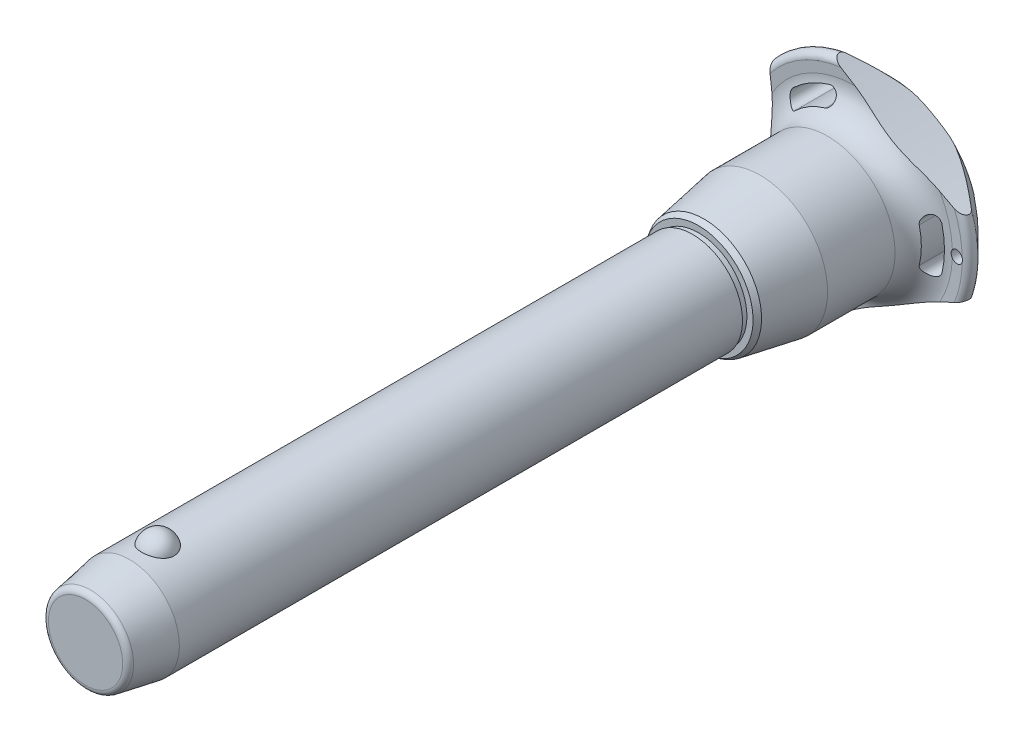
from build123d import *

# Parameters (mm, degrees)
SKETCH1_R           = 12.5
BOSS_EXTRUDE1_DEPTH = 130
SKETCH2_R           = 10
BOSS_EXTRUDE2_DEPTH = 50.7
BOSS_EXTRUDE3_START = 22
SKETCH1_2_R         = 12.5
BOSS_EXTRUDE3_DEPTH = 22
CHAMFER1_SIZE       = 11
CHAMFER1_SIZE2      = 1.939596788
FILLET1_R           = 1.5
SKETCH6_R           = 176.92625
CUT_EXTRUDE1_DEPTH  = 186.156340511
CIRPATTERN1_COUNT   = 3
SKETCH7_R           = 1.5
CUT_EXTRUDE2_DEPTH  = 186.074106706


with BuildPart() as part:
    # Sketch1 → Boss-Extrude1 (new body)
    with BuildSketch(Plane.XY):
        Circle(SKETCH1_R)
    extrude(amount=-BOSS_EXTRUDE1_DEPTH)

    # Sketch2 → Boss-Extrude2 (add)
    with BuildSketch(Plane(origin=(0, 0, -130), x_dir=(-1, 0, 0), z_dir=(0, 0, -1))):
        with Locations(Location((0, 0, 0), (0, 0, 180))):
            Circle(SKETCH2_R)
    extrude(amount=BOSS_EXTRUDE2_DEPTH)

    # Sketch3 → Revolve1 (revolve)
    with BuildSketch(Plane(origin=(0, 0, 0), x_dir=(0, 0, -1), z_dir=(1, 0, 0))):
        with BuildLine():
            Line((-3.957271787, 15.4), (-3.957271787, 7.1))
            ThreePointArc((-3.957271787, 7.1), (0.192728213, 11.25), (-3.957271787, 15.4))
        make_face()
        with BuildLine():
            Line((-3.957271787, -7.1), (-3.957271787, -15.4))
            ThreePointArc((-3.957271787, -15.4), (0.192728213, -11.25), (-3.957271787, -7.1))
        make_face()
    revolve(axis=Axis((0, -7.1, 3.957271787), (0, 1, 0)))

    # Sketch1_2 → Boss-Extrude3 (add)
    with BuildSketch(Plane.XY.offset(BOSS_EXTRUDE3_START)):
        Circle(SKETCH1_2_R)
    extrude(amount=-BOSS_EXTRUDE3_DEPTH)

    # Chamfer1
    chamfer1_edges = [part.edges().sort_by_distance(p)[0] for p in [
        (-12.5, 0, 22),
    ]]
    chamfer1_side = [part.faces().sort_by_distance(p)[0] for p in [
        (-12.5, 0, -54),
    ]]
    chamfer(chamfer1_edges, length=CHAMFER1_SIZE, length2=CHAMFER1_SIZE2, reference=chamfer1_side[0])

    # Fillet1
    fillet1_edges = [part.edges().sort_by_distance(p)[0] for p in [
        (-10.560403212, 0, 22),
        (-10, 0, -180.7),
    ]]
    fillet(fillet1_edges, radius=FILLET1_R)

    # Sketch4 → Revolve2 (revolve)
    with BuildSketch(Plane(origin=(0, 0, 0), x_dir=(0, 0, -1), z_dir=(1, 0, 0)), mode=Mode.PRIVATE) as revolve2_sk:
        Polygon((130, 0), (130, 12.089202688), (131.5, 12.089202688), (131.5, 13.644437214), (132.846872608, 14.422054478), (146.9, 16.9), (163.8, 16.9), (163.8, 0), align=None)
    revolve(revolve2_sk.sketch.rotate(Axis((0, 0, -163.8), (0, 0, 1)), 90), axis=Axis((0, 0, -163.8), (0, 0, 1)))

    # Sketch5 → Revolve3 (revolve)
    with BuildSketch(Plane(origin=(0, 0, 0), x_dir=(0, 0, -1), z_dir=(1, 0, 0)), mode=Mode.PRIVATE) as revolve3_sk:
        with BuildLine():
            Line((170.790129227, 24.271609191), (170.652256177, 26.865060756))
            ThreePointArc((170.652256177, 26.865060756), (171.598671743, 28.411427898), (173.38137085, 28.08137085))
            Line((173.38137085, 28.08137085), (179.763226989, 21.69951471))
            ThreePointArc((179.763226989, 21.69951471), (180.7, 19.381044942), (179.683055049, 17.096604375))
            ThreePointArc((179.683055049, 17.096604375), (174.18864484, 9.321268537), (172.25, 0))
            Line((172.25, 0), (163.8, 0))
            Line((163.8, 0), (163.8, 16.9))
            ThreePointArc((163.8, 16.9), (168.879432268, 19.083427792), (170.790129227, 24.271609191))
        make_face()
    revolve(revolve3_sk.sketch.rotate(Axis((0, 0, -172.25), (0, 0, 1)), 90), axis=Axis((0, 0, -172.25), (0, 0, 1)))

    # Sketch6 → Cut-Extrude1 (cut, through all)
    with BuildSketch(Plane.XY):
        with Locations((-197.42625, 0)):
            Circle(SKETCH6_R)
        with BuildLine():
            ThreePointArc((21.802992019, -5.260839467), (22.428706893, 0), (21.802992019, 5.260839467))
            ThreePointArc((21.802992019, 5.260839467), (19.579234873, 6.620060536), (18.220013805, 4.39630339))
            ThreePointArc((18.220013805, 4.39630339), (18.742902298, 0), (18.220013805, -4.39630339))
            ThreePointArc((18.220013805, -4.39630339), (19.579234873, -6.620060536), (21.802992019, -5.260839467))
        make_face()
    cut_extrude1 = extrude(amount=-CUT_EXTRUDE1_DEPTH, mode=Mode.SUBTRACT)

    # CirPattern1: Cut-Extrude1 ×3 about axis
    cirpattern1_axis = Axis((0, 0, 0), (0, 0, 1))
    for i in range(1, CIRPATTERN1_COUNT):
        add(cut_extrude1.rotate(cirpattern1_axis, i * 360 / CIRPATTERN1_COUNT), mode=Mode.SUBTRACT)

    # Sketch7 → Cut-Extrude2 (cut, through all)
    with BuildSketch(Plane.XY):
        with Locations(Location((25.428706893, 0, 0), (0, 0, 17.230769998))):
            Circle(SKETCH7_R)
    extrude(amount=-CUT_EXTRUDE2_DEPTH, mode=Mode.SUBTRACT)


solid = part.part
